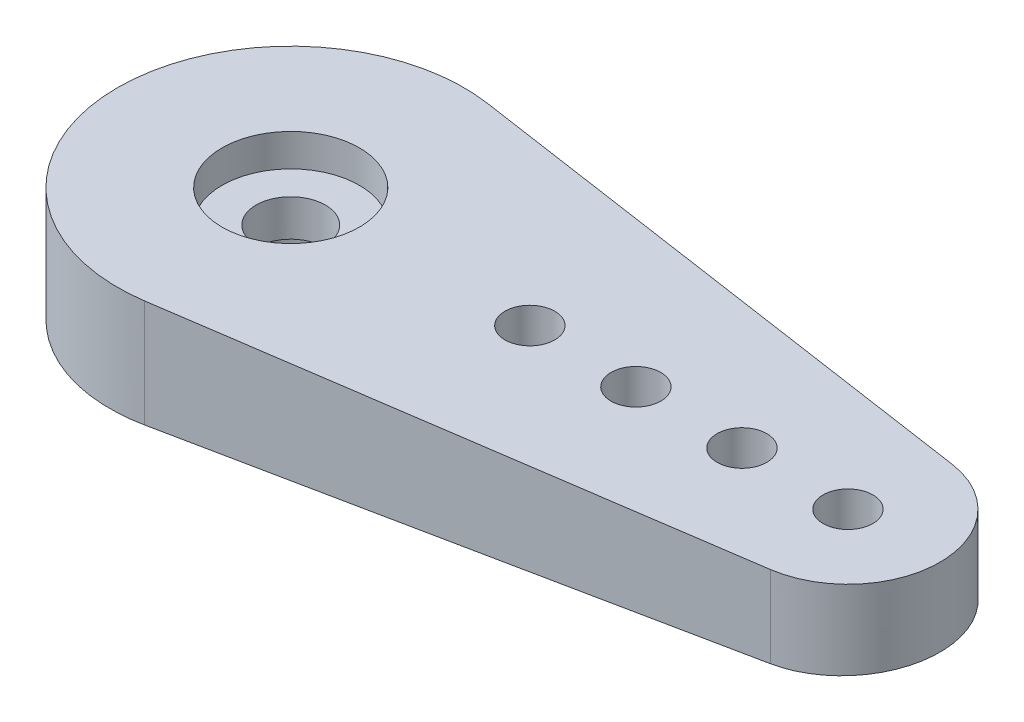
ISO-10303-21;
HEADER;
FILE_DESCRIPTION(('STEP AP214'),'2;1');
FILE_NAME('part.step','',(''),(''),'','','');
FILE_SCHEMA(('AUTOMOTIVE_DESIGN { 1 0 10303 214 1 1 1 1 }'));
ENDSEC;
DATA;
#1=APPLICATION_CONTEXT('core data for automotive mechanical design processes');
#2=APPLICATION_PROTOCOL_DEFINITION('international standard','automotive_design',2000,#1);
#3=PRODUCT_CONTEXT('',#1,'mechanical');
#4=PRODUCT('Part','Part','',(#3));
#5=PRODUCT_RELATED_PRODUCT_CATEGORY('part','',(#4));
#6=PRODUCT_DEFINITION_FORMATION('','',#4);
#7=PRODUCT_DEFINITION_CONTEXT('part definition',#1,'design');
#8=PRODUCT_DEFINITION('design','',#6,#7);
#9=PRODUCT_DEFINITION_SHAPE('','',#8);
#10=(LENGTH_UNIT() NAMED_UNIT(*) SI_UNIT(.MILLI.,.METRE.));
#11=(NAMED_UNIT(*) PLANE_ANGLE_UNIT() SI_UNIT($,.RADIAN.));
#12=(NAMED_UNIT(*) SI_UNIT($,.STERADIAN.) SOLID_ANGLE_UNIT());
#13=UNCERTAINTY_MEASURE_WITH_UNIT(LENGTH_MEASURE(1.E-05),#10,'distance_accuracy_value','');
#14=(GEOMETRIC_REPRESENTATION_CONTEXT(3) GLOBAL_UNCERTAINTY_ASSIGNED_CONTEXT((#13)) GLOBAL_UNIT_ASSIGNED_CONTEXT((#10,
#11,#12)) REPRESENTATION_CONTEXT('',''));
#15=CARTESIAN_POINT('',(0.,0.,0.));
#16=DIRECTION('',(0.,0.,1.));
#17=DIRECTION('',(1.,0.,0.));
#18=AXIS2_PLACEMENT_3D('',#15,#16,#17);
#19=CARTESIAN_POINT('',(0.,0.,0.));
#20=DIRECTION('',(0.,1.,0.));
#21=DIRECTION('',(0.,0.,1.));
#22=AXIS2_PLACEMENT_3D('',#19,#20,#21);
#23=PLANE('',#22);
#24=CARTESIAN_POINT('',(15.95,0.,0.));
#25=DIRECTION('',(0.,1.,0.));
#26=DIRECTION('',(0.,0.,1.));
#27=AXIS2_PLACEMENT_3D('',#24,#25,#26);
#28=CIRCLE('',#27,1.15);
#29=CARTESIAN_POINT('',(15.95,0.,1.15));
#30=VERTEX_POINT('',#29);
#31=EDGE_CURVE('E243',#30,#30,#28,.T.);
#32=ORIENTED_EDGE('',*,*,#31,.T.);
#33=EDGE_LOOP('',(#32));
#34=FACE_BOUND('',#33,.T.);
#35=CARTESIAN_POINT('',(25.75,0.,0.));
#36=DIRECTION('',(0.,1.,0.));
#37=DIRECTION('',(0.,0.,1.));
#38=AXIS2_PLACEMENT_3D('',#35,#36,#37);
#39=CIRCLE('',#38,1.15);
#40=CARTESIAN_POINT('',(25.75,0.,1.15));
#41=VERTEX_POINT('',#40);
#42=EDGE_CURVE('E231',#41,#41,#39,.T.);
#43=ORIENTED_EDGE('',*,*,#42,.T.);
#44=EDGE_LOOP('',(#43));
#45=FACE_BOUND('',#44,.T.);
#46=CARTESIAN_POINT('',(20.85,0.,0.));
#47=DIRECTION('',(0.,1.,0.));
#48=DIRECTION('',(0.,0.,1.));
#49=AXIS2_PLACEMENT_3D('',#46,#47,#48);
#50=CIRCLE('',#49,1.15);
#51=CARTESIAN_POINT('',(20.85,0.,1.15));
#52=VERTEX_POINT('',#51);
#53=EDGE_CURVE('E237',#52,#52,#50,.T.);
#54=ORIENTED_EDGE('',*,*,#53,.T.);
#55=EDGE_LOOP('',(#54));
#56=FACE_BOUND('',#55,.T.);
#57=CARTESIAN_POINT('',(11.05,0.,0.));
#58=DIRECTION('',(0.,1.,0.));
#59=DIRECTION('',(0.,0.,1.));
#60=AXIS2_PLACEMENT_3D('',#57,#58,#59);
#61=CIRCLE('',#60,1.15);
#62=CARTESIAN_POINT('',(11.05,0.,1.15000000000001));
#63=VERTEX_POINT('',#62);
#64=EDGE_CURVE('E208',#63,#63,#61,.T.);
#65=ORIENTED_EDGE('',*,*,#64,.T.);
#66=EDGE_LOOP('',(#65));
#67=FACE_BOUND('',#66,.T.);
#68=DIRECTION('',(0.,0.,1.));
#69=VECTOR('',#68,1.);
#70=CARTESIAN_POINT('',(0.6,0.,-5.3665631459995));
#71=LINE('',#70,#69);
#72=CARTESIAN_POINT('',(0.6,0.,-6.67308024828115));
#73=VERTEX_POINT('',#72);
#74=CARTESIAN_POINT('',(0.6,0.,-5.3665631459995));
#75=VERTEX_POINT('',#74);
#76=EDGE_CURVE('E193',#73,#75,#71,.T.);
#77=ORIENTED_EDGE('',*,*,#76,.F.);
#78=CARTESIAN_POINT('',(0.,0.,0.));
#79=DIRECTION('',(0.,-1.,0.));
#80=DIRECTION('',(0.,0.,-1.));
#81=AXIS2_PLACEMENT_3D('',#78,#79,#80);
#82=CIRCLE('',#81,6.7);
#83=CARTESIAN_POINT('',(0.975728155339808,0.,-6.6285710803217));
#84=VERTEX_POINT('',#83);
#85=EDGE_CURVE('E274',#73,#84,#82,.T.);
#86=ORIENTED_EDGE('',*,*,#85,.T.);
#87=DIRECTION('',(0.989338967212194,0.,0.145631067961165));
#88=VECTOR('',#87,1.);
#89=CARTESIAN_POINT('',(0.975728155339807,0.,-6.6285710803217));
#90=LINE('',#89,#88);
#91=CARTESIAN_POINT('',(26.1796116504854,0.,-2.91854995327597));
#92=VERTEX_POINT('',#91);
#93=EDGE_CURVE('E267',#84,#92,#90,.T.);
#94=ORIENTED_EDGE('',*,*,#93,.T.);
#95=CARTESIAN_POINT('',(25.75,0.,0.));
#96=DIRECTION('',(0.,-1.,0.));
#97=DIRECTION('',(0.,0.,-1.));
#98=AXIS2_PLACEMENT_3D('',#95,#96,#97);
#99=CIRCLE('',#98,2.95);
#100=CARTESIAN_POINT('',(26.1796116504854,0.,2.91854995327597));
#101=VERTEX_POINT('',#100);
#102=EDGE_CURVE('E278',#92,#101,#99,.T.);
#103=ORIENTED_EDGE('',*,*,#102,.T.);
#104=DIRECTION('',(-0.989338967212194,0.,0.145631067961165));
#105=VECTOR('',#104,1.);
#106=CARTESIAN_POINT('',(26.1796116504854,0.,2.91854995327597));
#107=LINE('',#106,#105);
#108=CARTESIAN_POINT('',(0.97572815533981,0.,6.6285710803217));
#109=VERTEX_POINT('',#108);
#110=EDGE_CURVE('E275',#101,#109,#107,.T.);
#111=ORIENTED_EDGE('',*,*,#110,.T.);
#112=CARTESIAN_POINT('',(0.6,0.,6.67308024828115));
#113=VERTEX_POINT('',#112);
#114=EDGE_CURVE('E270',#109,#113,#82,.T.);
#115=ORIENTED_EDGE('',*,*,#114,.T.);
#116=DIRECTION('',(0.,0.,1.));
#117=VECTOR('',#116,1.);
#118=CARTESIAN_POINT('',(0.6,0.,5.3665631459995));
#119=LINE('',#118,#117);
#120=CARTESIAN_POINT('',(0.6,0.,5.3665631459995));
#121=VERTEX_POINT('',#120);
#122=EDGE_CURVE('E327',#121,#113,#119,.T.);
#123=ORIENTED_EDGE('',*,*,#122,.F.);
#124=CARTESIAN_POINT('',(0.,0.,0.));
#125=DIRECTION('',(0.,1.,0.));
#126=DIRECTION('',(0.,0.,1.));
#127=AXIS2_PLACEMENT_3D('',#124,#125,#126);
#128=CIRCLE('',#127,5.4);
#129=EDGE_CURVE('E47',#75,#121,#128,.F.);
#130=ORIENTED_EDGE('',*,*,#129,.F.);
#131=EDGE_LOOP('',(#77,#86,#94,#103,#111,#115,#123,#130));
#132=FACE_BOUND('',#131,.T.);
#133=ADVANCED_FACE('F37',(#34,#45,#56,#67,#132),#23,.F.);
#134=DIRECTION('',(0.,0.,-1.));
#135=VECTOR('',#134,1.);
#136=CARTESIAN_POINT('',(-0.6,0.,-5.3665631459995));
#137=LINE('',#136,#135);
#138=CARTESIAN_POINT('',(-0.6,0.,-5.3665631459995));
#139=VERTEX_POINT('',#138);
#140=CARTESIAN_POINT('',(-0.599999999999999,0.,-6.67308024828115));
#141=VERTEX_POINT('',#140);
#142=EDGE_CURVE('E179',#139,#141,#137,.T.);
#143=ORIENTED_EDGE('',*,*,#142,.F.);
#144=CARTESIAN_POINT('',(-5.3665631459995,0.,-0.6));
#145=VERTEX_POINT('',#144);
#146=EDGE_CURVE('E46',#145,#139,#128,.F.);
#147=ORIENTED_EDGE('',*,*,#146,.F.);
#148=DIRECTION('',(1.,0.,0.));
#149=VECTOR('',#148,1.);
#150=CARTESIAN_POINT('',(-6.67308024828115,0.,-0.6));
#151=LINE('',#150,#149);
#152=CARTESIAN_POINT('',(-6.67308024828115,0.,-0.600000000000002));
#153=VERTEX_POINT('',#152);
#154=EDGE_CURVE('E344',#153,#145,#151,.T.);
#155=ORIENTED_EDGE('',*,*,#154,.F.);
#156=EDGE_CURVE('E192',#153,#141,#82,.T.);
#157=ORIENTED_EDGE('',*,*,#156,.T.);
#158=EDGE_LOOP('',(#143,#147,#155,#157));
#159=FACE_BOUND('',#158,.T.);
#160=ADVANCED_FACE('F189',(#159),#23,.F.);
#161=CARTESIAN_POINT('',(0.,-4.,0.));
#162=DIRECTION('',(0.,1.,0.));
#163=DIRECTION('',(0.,0.,1.));
#164=AXIS2_PLACEMENT_3D('',#161,#162,#163);
#165=CYLINDRICAL_SURFACE('',#164,6.7);
#166=ORIENTED_EDGE('',*,*,#85,.F.);
#167=DIRECTION('',(0.,1.,0.));
#168=VECTOR('',#167,1.);
#169=CARTESIAN_POINT('',(0.6,-3.60173884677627,-6.67308024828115));
#170=LINE('',#169,#168);
#171=CARTESIAN_POINT('',(0.6,-1.49263157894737,-6.67308024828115));
#172=VERTEX_POINT('',#171);
#173=EDGE_CURVE('E353',#172,#73,#170,.T.);
#174=ORIENTED_EDGE('',*,*,#173,.F.);
#175=CARTESIAN_POINT('',(0.,-1.52105263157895,0.));
#176=DIRECTION('',(-0.0473153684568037,0.998880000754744,0.));
#177=DIRECTION('',(0.998880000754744,0.0473153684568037,0.));
#178=AXIS2_PLACEMENT_3D('',#175,#176,#177);
#179=ELLIPSE('',#178,6.70751240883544,6.7);
#180=CARTESIAN_POINT('',(0.975728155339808,-1.47483392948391,-6.6285710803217));
#181=VERTEX_POINT('',#180);
#182=EDGE_CURVE('E295',#181,#172,#179,.T.);
#183=ORIENTED_EDGE('',*,*,#182,.F.);
#184=DIRECTION('',(0.,1.,0.));
#185=VECTOR('',#184,1.);
#186=CARTESIAN_POINT('',(0.975728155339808,-4.,-6.6285710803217));
#187=LINE('',#186,#185);
#188=EDGE_CURVE('E262',#181,#84,#187,.T.);
#189=ORIENTED_EDGE('',*,*,#188,.T.);
#190=EDGE_LOOP('',(#166,#174,#183,#189));
#191=FACE_BOUND('',#190,.T.);
#192=ADVANCED_FACE('F374',(#191),#165,.F.);
#193=CARTESIAN_POINT('',(-0.6,-1.54947368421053,-6.67308024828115));
#194=VERTEX_POINT('',#193);
#195=CARTESIAN_POINT('',(-6.67308024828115,-1.83714590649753,-0.600000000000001));
#196=VERTEX_POINT('',#195);
#197=EDGE_CURVE('E298',#194,#196,#179,.T.);
#198=ORIENTED_EDGE('',*,*,#197,.F.);
#199=DIRECTION('',(0.,1.,0.));
#200=VECTOR('',#199,1.);
#201=CARTESIAN_POINT('',(-0.599999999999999,-3.60173884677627,-6.67308024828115));
#202=LINE('',#201,#200);
#203=EDGE_CURVE('E54',#194,#141,#202,.T.);
#204=ORIENTED_EDGE('',*,*,#203,.T.);
#205=ORIENTED_EDGE('',*,*,#156,.F.);
#206=DIRECTION('',(0.,1.,0.));
#207=VECTOR('',#206,1.);
#208=CARTESIAN_POINT('',(-6.67308024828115,-3.60173884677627,-0.600000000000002));
#209=LINE('',#208,#207);
#210=EDGE_CURVE('E341',#196,#153,#209,.T.);
#211=ORIENTED_EDGE('',*,*,#210,.F.);
#212=EDGE_LOOP('',(#198,#204,#205,#211));
#213=FACE_BOUND('',#212,.T.);
#214=ADVANCED_FACE('F436',(#213),#165,.F.);
#215=CARTESIAN_POINT('',(0.,-25.7735064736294,0.));
#216=DIRECTION('',(0.,1.,0.));
#217=DIRECTION('',(0.,0.,1.));
#218=AXIS2_PLACEMENT_3D('',#215,#216,#217);
#219=CYLINDRICAL_SURFACE('',#218,5.4);
#220=CARTESIAN_POINT('',(0.,-3.5,0.));
#221=DIRECTION('',(0.,1.,0.));
#222=DIRECTION('',(0.,0.,1.));
#223=AXIS2_PLACEMENT_3D('',#220,#221,#222);
#224=CIRCLE('',#223,5.4);
#225=CARTESIAN_POINT('',(0.,-3.5,5.4));
#226=VERTEX_POINT('',#225);
#227=EDGE_CURVE('E300',#226,#226,#224,.T.);
#228=ORIENTED_EDGE('',*,*,#227,.T.);
#229=EDGE_LOOP('',(#228));
#230=FACE_BOUND('',#229,.T.);
#231=DIRECTION('',(0.,1.,0.));
#232=VECTOR('',#231,1.);
#233=CARTESIAN_POINT('',(0.6,-3.60173884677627,-5.3665631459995));
#234=LINE('',#233,#232);
#235=CARTESIAN_POINT('',(0.6,-1.49263157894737,-5.3665631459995));
#236=VERTEX_POINT('',#235);
#237=EDGE_CURVE('E355',#236,#75,#234,.T.);
#238=ORIENTED_EDGE('',*,*,#237,.T.);
#239=ORIENTED_EDGE('',*,*,#129,.T.);
#240=DIRECTION('',(0.,1.,0.));
#241=VECTOR('',#240,1.);
#242=CARTESIAN_POINT('',(0.6,-3.60173884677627,5.3665631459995));
#243=LINE('',#242,#241);
#244=CARTESIAN_POINT('',(0.6,-1.49263157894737,5.3665631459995));
#245=VERTEX_POINT('',#244);
#246=EDGE_CURVE('E314',#245,#121,#243,.T.);
#247=ORIENTED_EDGE('',*,*,#246,.F.);
#248=CARTESIAN_POINT('',(0.,-1.52105263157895,0.));
#249=DIRECTION('',(-0.0473153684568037,0.998880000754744,0.));
#250=DIRECTION('',(0.998880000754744,0.0473153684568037,0.));
#251=AXIS2_PLACEMENT_3D('',#248,#249,#250);
#252=ELLIPSE('',#251,5.40605477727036,5.4);
#253=CARTESIAN_POINT('',(-0.6,-1.54947368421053,5.3665631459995));
#254=VERTEX_POINT('',#253);
#255=EDGE_CURVE('E307',#245,#254,#252,.F.);
#256=ORIENTED_EDGE('',*,*,#255,.T.);
#257=DIRECTION('',(0.,1.,0.));
#258=VECTOR('',#257,1.);
#259=CARTESIAN_POINT('',(-0.6,-3.60173884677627,5.3665631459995));
#260=LINE('',#259,#258);
#261=CARTESIAN_POINT('',(-0.6,0.,5.3665631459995));
#262=VERTEX_POINT('',#261);
#263=EDGE_CURVE('E322',#254,#262,#260,.T.);
#264=ORIENTED_EDGE('',*,*,#263,.T.);
#265=CARTESIAN_POINT('',(-5.3665631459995,0.,0.6));
#266=VERTEX_POINT('',#265);
#267=EDGE_CURVE('E12',#262,#266,#128,.F.);
#268=ORIENTED_EDGE('',*,*,#267,.T.);
#269=DIRECTION('',(0.,1.,0.));
#270=VECTOR('',#269,1.);
#271=CARTESIAN_POINT('',(-5.3665631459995,-3.60173884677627,0.6));
#272=LINE('',#271,#270);
#273=CARTESIAN_POINT('',(-5.3665631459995,-1.77525825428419,0.6));
#274=VERTEX_POINT('',#273);
#275=EDGE_CURVE('E338',#274,#266,#272,.T.);
#276=ORIENTED_EDGE('',*,*,#275,.F.);
#277=CARTESIAN_POINT('',(0.,-1.52105263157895,0.));
#278=DIRECTION('',(-0.0473153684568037,0.998880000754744,0.));
#279=DIRECTION('',(0.998880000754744,0.0473153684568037,0.));
#280=AXIS2_PLACEMENT_3D('',#277,#278,#279);
#281=ELLIPSE('',#280,5.40605477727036,5.4);
#282=CARTESIAN_POINT('',(-5.3665631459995,-1.77525825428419,-0.6));
#283=VERTEX_POINT('',#282);
#284=EDGE_CURVE('E330',#274,#283,#281,.F.);
#285=ORIENTED_EDGE('',*,*,#284,.T.);
#286=DIRECTION('',(0.,1.,0.));
#287=VECTOR('',#286,1.);
#288=CARTESIAN_POINT('',(-5.3665631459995,-3.60173884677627,-0.6));
#289=LINE('',#288,#287);
#290=EDGE_CURVE('E200',#283,#145,#289,.T.);
#291=ORIENTED_EDGE('',*,*,#290,.T.);
#292=ORIENTED_EDGE('',*,*,#146,.T.);
#293=DIRECTION('',(0.,1.,0.));
#294=VECTOR('',#293,1.);
#295=CARTESIAN_POINT('',(-0.6,-3.60173884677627,-5.3665631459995));
#296=LINE('',#295,#294);
#297=CARTESIAN_POINT('',(-0.6,-1.54947368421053,-5.3665631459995));
#298=VERTEX_POINT('',#297);
#299=EDGE_CURVE('E176',#298,#139,#296,.T.);
#300=ORIENTED_EDGE('',*,*,#299,.F.);
#301=CARTESIAN_POINT('',(0.,-1.52105263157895,0.));
#302=DIRECTION('',(-0.0473153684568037,0.998880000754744,0.));
#303=DIRECTION('',(0.998880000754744,0.0473153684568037,0.));
#304=AXIS2_PLACEMENT_3D('',#301,#302,#303);
#305=ELLIPSE('',#304,5.40605477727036,5.4);
#306=EDGE_CURVE('E348',#298,#236,#305,.F.);
#307=ORIENTED_EDGE('',*,*,#306,.T.);
#308=EDGE_LOOP('',(#238,#239,#247,#256,#264,#268,#276,#285,#291,#292,#300,#307));
#309=FACE_BOUND('',#308,.T.);
#310=ADVANCED_FACE('F197',(#230,#309),#219,.T.);
#311=DIRECTION('',(-1.,0.,0.));
#312=VECTOR('',#311,1.);
#313=CARTESIAN_POINT('',(-5.3665631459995,0.,0.6));
#314=LINE('',#313,#312);
#315=CARTESIAN_POINT('',(-6.67308024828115,0.,0.6));
#316=VERTEX_POINT('',#315);
#317=EDGE_CURVE('E346',#266,#316,#314,.T.);
#318=ORIENTED_EDGE('',*,*,#317,.F.);
#319=ORIENTED_EDGE('',*,*,#267,.F.);
#320=DIRECTION('',(0.,0.,-1.));
#321=VECTOR('',#320,1.);
#322=CARTESIAN_POINT('',(-0.6,0.,6.67308024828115));
#323=LINE('',#322,#321);
#324=CARTESIAN_POINT('',(-0.6,0.,6.67308024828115));
#325=VERTEX_POINT('',#324);
#326=EDGE_CURVE('E324',#325,#262,#323,.T.);
#327=ORIENTED_EDGE('',*,*,#326,.F.);
#328=EDGE_CURVE('E273',#325,#316,#82,.T.);
#329=ORIENTED_EDGE('',*,*,#328,.T.);
#330=EDGE_LOOP('',(#318,#319,#327,#329));
#331=FACE_BOUND('',#330,.T.);
#332=ADVANCED_FACE('F381',(#331),#23,.F.);
#333=CARTESIAN_POINT('',(-6.67308024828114,-1.83714590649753,0.6));
#334=VERTEX_POINT('',#333);
#335=CARTESIAN_POINT('',(-0.600000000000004,-1.54947368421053,6.67308024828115));
#336=VERTEX_POINT('',#335);
#337=EDGE_CURVE('E393',#334,#336,#179,.T.);
#338=ORIENTED_EDGE('',*,*,#337,.F.);
#339=DIRECTION('',(0.,1.,0.));
#340=VECTOR('',#339,1.);
#341=CARTESIAN_POINT('',(-6.67308024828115,-3.60173884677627,0.6));
#342=LINE('',#341,#340);
#343=EDGE_CURVE('E62',#334,#316,#342,.T.);
#344=ORIENTED_EDGE('',*,*,#343,.T.);
#345=ORIENTED_EDGE('',*,*,#328,.F.);
#346=DIRECTION('',(0.,1.,0.));
#347=VECTOR('',#346,1.);
#348=CARTESIAN_POINT('',(-0.6,-3.60173884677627,6.67308024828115));
#349=LINE('',#348,#347);
#350=EDGE_CURVE('E319',#336,#325,#349,.T.);
#351=ORIENTED_EDGE('',*,*,#350,.F.);
#352=EDGE_LOOP('',(#338,#344,#345,#351));
#353=FACE_BOUND('',#352,.T.);
#354=ADVANCED_FACE('F386',(#353),#165,.F.);
#355=CARTESIAN_POINT('',(0.6,-1.49263157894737,6.67308024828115));
#356=VERTEX_POINT('',#355);
#357=CARTESIAN_POINT('',(0.97572815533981,-1.4748339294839,6.6285710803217));
#358=VERTEX_POINT('',#357);
#359=EDGE_CURVE('E299',#356,#358,#179,.T.);
#360=ORIENTED_EDGE('',*,*,#359,.F.);
#361=DIRECTION('',(0.,1.,0.));
#362=VECTOR('',#361,1.);
#363=CARTESIAN_POINT('',(0.600000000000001,-3.60173884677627,6.67308024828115));
#364=LINE('',#363,#362);
#365=EDGE_CURVE('E317',#356,#113,#364,.T.);
#366=ORIENTED_EDGE('',*,*,#365,.T.);
#367=ORIENTED_EDGE('',*,*,#114,.F.);
#368=DIRECTION('',(0.,1.,0.));
#369=VECTOR('',#368,1.);
#370=CARTESIAN_POINT('',(0.97572815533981,-4.,6.6285710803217));
#371=LINE('',#370,#369);
#372=EDGE_CURVE('E260',#358,#109,#371,.T.);
#373=ORIENTED_EDGE('',*,*,#372,.F.);
#374=EDGE_LOOP('',(#360,#366,#367,#373));
#375=FACE_BOUND('',#374,.T.);
#376=ADVANCED_FACE('F404',(#375),#165,.F.);
#377=CARTESIAN_POINT('',(0.,3.5,0.));
#378=DIRECTION('',(0.,-1.,0.));
#379=DIRECTION('',(0.,0.,-1.));
#380=AXIS2_PLACEMENT_3D('',#377,#378,#379);
#381=CYLINDRICAL_SURFACE('',#380,1.6);
#382=CARTESIAN_POINT('',(0.,2.,0.));
#383=DIRECTION('',(0.,1.,0.));
#384=DIRECTION('',(0.,0.,1.));
#385=AXIS2_PLACEMENT_3D('',#382,#383,#384);
#386=CIRCLE('',#385,1.6);
#387=CARTESIAN_POINT('',(0.,2.,1.6));
#388=VERTEX_POINT('',#387);
#389=EDGE_CURVE('E205',#388,#388,#386,.T.);
#390=ORIENTED_EDGE('',*,*,#389,.T.);
#391=EDGE_LOOP('',(#390));
#392=FACE_BOUND('',#391,.T.);
#393=CARTESIAN_POINT('',(0.,0.3,0.));
#394=DIRECTION('',(0.,-1.,0.));
#395=DIRECTION('',(0.,0.,-1.));
#396=AXIS2_PLACEMENT_3D('',#393,#394,#395);
#397=CIRCLE('',#396,1.6);
#398=CARTESIAN_POINT('',(0.,0.3,-1.6));
#399=VERTEX_POINT('',#398);
#400=EDGE_CURVE('E41',#399,#399,#397,.T.);
#401=ORIENTED_EDGE('',*,*,#400,.T.);
#402=EDGE_LOOP('',(#401));
#403=FACE_BOUND('',#402,.T.);
#404=ADVANCED_FACE('F519',(#392,#403),#381,.F.);
#405=CARTESIAN_POINT('',(0.,3.5,0.));
#406=DIRECTION('',(0.,1.,0.));
#407=DIRECTION('',(0.,0.,1.));
#408=AXIS2_PLACEMENT_3D('',#405,#406,#407);
#409=PLANE('',#408);
#410=CARTESIAN_POINT('',(0.,3.5,0.));
#411=DIRECTION('',(0.,1.,0.));
#412=DIRECTION('',(0.,0.,1.));
#413=AXIS2_PLACEMENT_3D('',#410,#411,#412);
#414=CIRCLE('',#413,3.175);
#415=CARTESIAN_POINT('',(0.,3.5,3.175));
#416=VERTEX_POINT('',#415);
#417=EDGE_CURVE('E253',#416,#416,#414,.T.);
#418=ORIENTED_EDGE('',*,*,#417,.F.);
#419=EDGE_LOOP('',(#418));
#420=FACE_BOUND('',#419,.T.);
#421=CARTESIAN_POINT('',(15.95,3.5,0.));
#422=DIRECTION('',(0.,1.,0.));
#423=DIRECTION('',(0.,0.,1.));
#424=AXIS2_PLACEMENT_3D('',#421,#422,#423);
#425=CIRCLE('',#424,1.15);
#426=CARTESIAN_POINT('',(15.95,3.5,1.15));
#427=VERTEX_POINT('',#426);
#428=EDGE_CURVE('E240',#427,#427,#425,.T.);
#429=ORIENTED_EDGE('',*,*,#428,.F.);
#430=EDGE_LOOP('',(#429));
#431=FACE_BOUND('',#430,.T.);
#432=CARTESIAN_POINT('',(25.75,3.5,0.));
#433=DIRECTION('',(0.,1.,0.));
#434=DIRECTION('',(0.,0.,1.));
#435=AXIS2_PLACEMENT_3D('',#432,#433,#434);
#436=CIRCLE('',#435,1.15);
#437=CARTESIAN_POINT('',(25.75,3.5,1.15));
#438=VERTEX_POINT('',#437);
#439=EDGE_CURVE('E230',#438,#438,#436,.T.);
#440=ORIENTED_EDGE('',*,*,#439,.F.);
#441=EDGE_LOOP('',(#440));
#442=FACE_BOUND('',#441,.T.);
#443=CARTESIAN_POINT('',(0.,3.5,0.));
#444=DIRECTION('',(0.,1.,0.));
#445=DIRECTION('',(0.,0.,1.));
#446=AXIS2_PLACEMENT_3D('',#443,#444,#445);
#447=CIRCLE('',#446,8.);
#448=CARTESIAN_POINT('',(1.16504854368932,3.5,-7.91471173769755));
#449=VERTEX_POINT('',#448);
#450=CARTESIAN_POINT('',(1.16504854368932,3.5,7.91471173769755));
#451=VERTEX_POINT('',#450);
#452=EDGE_CURVE('E227',#449,#451,#447,.T.);
#453=ORIENTED_EDGE('',*,*,#452,.T.);
#454=DIRECTION('',(0.989338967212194,0.,-0.145631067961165));
#455=VECTOR('',#454,1.);
#456=CARTESIAN_POINT('',(1.16504854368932,3.5,7.91471173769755));
#457=LINE('',#456,#455);
#458=CARTESIAN_POINT('',(26.368932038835,3.5,4.20469061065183));
#459=VERTEX_POINT('',#458);
#460=EDGE_CURVE('E225',#451,#459,#457,.T.);
#461=ORIENTED_EDGE('',*,*,#460,.T.);
#462=CARTESIAN_POINT('',(25.75,3.5,0.));
#463=DIRECTION('',(0.,1.,0.));
#464=DIRECTION('',(0.,0.,1.));
#465=AXIS2_PLACEMENT_3D('',#462,#463,#464);
#466=CIRCLE('',#465,4.25);
#467=CARTESIAN_POINT('',(26.368932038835,3.5,-4.20469061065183));
#468=VERTEX_POINT('',#467);
#469=EDGE_CURVE('E223',#459,#468,#466,.T.);
#470=ORIENTED_EDGE('',*,*,#469,.T.);
#471=DIRECTION('',(-0.989338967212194,0.,-0.145631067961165));
#472=VECTOR('',#471,1.);
#473=CARTESIAN_POINT('',(26.368932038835,3.5,-4.20469061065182));
#474=LINE('',#473,#472);
#475=EDGE_CURVE('E221',#468,#449,#474,.T.);
#476=ORIENTED_EDGE('',*,*,#475,.T.);
#477=EDGE_LOOP('',(#453,#461,#470,#476));
#478=FACE_BOUND('',#477,.T.);
#479=CARTESIAN_POINT('',(20.85,3.5,0.));
#480=DIRECTION('',(0.,1.,0.));
#481=DIRECTION('',(0.,0.,1.));
#482=AXIS2_PLACEMENT_3D('',#479,#480,#481);
#483=CIRCLE('',#482,1.15);
#484=CARTESIAN_POINT('',(20.85,3.5,1.15));
#485=VERTEX_POINT('',#484);
#486=EDGE_CURVE('E234',#485,#485,#483,.T.);
#487=ORIENTED_EDGE('',*,*,#486,.F.);
#488=EDGE_LOOP('',(#487));
#489=FACE_BOUND('',#488,.T.);
#490=CARTESIAN_POINT('',(11.05,3.5,0.));
#491=DIRECTION('',(0.,1.,0.));
#492=DIRECTION('',(0.,0.,1.));
#493=AXIS2_PLACEMENT_3D('',#490,#491,#492);
#494=CIRCLE('',#493,1.15);
#495=CARTESIAN_POINT('',(11.05,3.5,1.15000000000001));
#496=VERTEX_POINT('',#495);
#497=EDGE_CURVE('E246',#496,#496,#494,.T.);
#498=ORIENTED_EDGE('',*,*,#497,.F.);
#499=EDGE_LOOP('',(#498));
#500=FACE_BOUND('',#499,.T.);
#501=ADVANCED_FACE('F582',(#420,#431,#442,#478,#489,#500),#409,.T.);
#502=CARTESIAN_POINT('',(0.,3.5,0.));
#503=DIRECTION('',(0.,-1.,0.));
#504=DIRECTION('',(0.,0.,-1.));
#505=AXIS2_PLACEMENT_3D('',#502,#503,#504);
#506=CYLINDRICAL_SURFACE('',#505,8.);
#507=DIRECTION('',(0.,-1.,0.));
#508=VECTOR('',#507,1.);
#509=CARTESIAN_POINT('',(1.16504854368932,3.5,-7.91471173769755));
#510=LINE('',#509,#508);
#511=CARTESIAN_POINT('',(1.16504854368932,-1.46586612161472,-7.91471173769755));
#512=VERTEX_POINT('',#511);
#513=EDGE_CURVE('E218',#449,#512,#510,.T.);
#514=ORIENTED_EDGE('',*,*,#513,.T.);
#515=CARTESIAN_POINT('',(0.,-1.52105263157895,0.));
#516=DIRECTION('',(-0.0473153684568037,0.998880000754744,0.));
#517=DIRECTION('',(-0.998880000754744,-0.0473153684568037,0.));
#518=AXIS2_PLACEMENT_3D('',#515,#516,#517);
#519=ELLIPSE('',#518,8.00897004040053,8.);
#520=CARTESIAN_POINT('',(1.16504854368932,-1.46586612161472,7.91471173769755));
#521=VERTEX_POINT('',#520);
#522=EDGE_CURVE('E281',#512,#521,#519,.T.);
#523=ORIENTED_EDGE('',*,*,#522,.T.);
#524=DIRECTION('',(0.,-1.,0.));
#525=VECTOR('',#524,1.);
#526=CARTESIAN_POINT('',(1.16504854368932,3.5,7.91471173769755));
#527=LINE('',#526,#525);
#528=EDGE_CURVE('E204',#451,#521,#527,.T.);
#529=ORIENTED_EDGE('',*,*,#528,.F.);
#530=ORIENTED_EDGE('',*,*,#452,.F.);
#531=EDGE_LOOP('',(#514,#523,#529,#530));
#532=FACE_BOUND('',#531,.T.);
#533=ADVANCED_FACE('F39',(#532),#506,.T.);
#534=CARTESIAN_POINT('',(1.16504854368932,3.5,7.91471173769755));
#535=DIRECTION('',(-0.145631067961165,0.,-0.989338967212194));
#536=DIRECTION('',(-0.989338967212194,0.,0.145631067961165));
#537=AXIS2_PLACEMENT_3D('',#534,#535,#536);
#538=PLANE('',#537);
#539=ORIENTED_EDGE('',*,*,#528,.T.);
#540=DIRECTION('',(0.988254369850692,0.0468120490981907,-0.145471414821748));
#541=VECTOR('',#540,1.);
#542=CARTESIAN_POINT('',(1.39478049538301,-1.45498408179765,7.88089510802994));
#543=LINE('',#542,#541);
#544=CARTESIAN_POINT('',(26.368932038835,-0.271997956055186,4.20469061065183));
#545=VERTEX_POINT('',#544);
#546=EDGE_CURVE('E282',#521,#545,#543,.T.);
#547=ORIENTED_EDGE('',*,*,#546,.T.);
#548=DIRECTION('',(0.,-1.,0.));
#549=VECTOR('',#548,1.);
#550=CARTESIAN_POINT('',(26.368932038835,3.5,4.20469061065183));
#551=LINE('',#550,#549);
#552=EDGE_CURVE('E212',#459,#545,#551,.T.);
#553=ORIENTED_EDGE('',*,*,#552,.F.);
#554=ORIENTED_EDGE('',*,*,#460,.F.);
#555=EDGE_LOOP('',(#539,#547,#553,#554));
#556=FACE_BOUND('',#555,.T.);
#557=ADVANCED_FACE('F627',(#556),#538,.F.);
#558=CARTESIAN_POINT('',(25.75,3.5,0.));
#559=DIRECTION('',(0.,-1.,0.));
#560=DIRECTION('',(0.,0.,-1.));
#561=AXIS2_PLACEMENT_3D('',#558,#559,#560);
#562=CYLINDRICAL_SURFACE('',#561,4.25);
#563=CARTESIAN_POINT('',(25.75,-0.301315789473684,0.));
#564=DIRECTION('',(-0.0473153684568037,0.998880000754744,0.));
#565=DIRECTION('',(-0.998880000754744,-0.0473153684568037,0.));
#566=AXIS2_PLACEMENT_3D('',#563,#564,#565);
#567=ELLIPSE('',#566,4.25476533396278,4.25);
#568=CARTESIAN_POINT('',(26.368932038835,-0.271997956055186,-4.20469061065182));
#569=VERTEX_POINT('',#568);
#570=EDGE_CURVE('E285',#545,#569,#567,.T.);
#571=ORIENTED_EDGE('',*,*,#570,.T.);
#572=DIRECTION('',(0.,-1.,0.));
#573=VECTOR('',#572,1.);
#574=CARTESIAN_POINT('',(26.368932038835,3.5,-4.20469061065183));
#575=LINE('',#574,#573);
#576=EDGE_CURVE('E215',#468,#569,#575,.T.);
#577=ORIENTED_EDGE('',*,*,#576,.F.);
#578=ORIENTED_EDGE('',*,*,#469,.F.);
#579=ORIENTED_EDGE('',*,*,#552,.T.);
#580=EDGE_LOOP('',(#571,#577,#578,#579));
#581=FACE_BOUND('',#580,.T.);
#582=ADVANCED_FACE('F616',(#581),#562,.T.);
#583=CARTESIAN_POINT('',(26.368932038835,3.5,-4.20469061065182));
#584=DIRECTION('',(-0.145631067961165,0.,0.989338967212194));
#585=DIRECTION('',(0.989338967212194,0.,0.145631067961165));
#586=AXIS2_PLACEMENT_3D('',#583,#584,#585);
#587=PLANE('',#586);
#588=ORIENTED_EDGE('',*,*,#576,.T.);
#589=DIRECTION('',(-0.988254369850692,-0.0468120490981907,-0.145471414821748));
#590=VECTOR('',#589,1.);
#591=CARTESIAN_POINT('',(26.5434330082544,-0.263732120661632,-4.1790040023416));
#592=LINE('',#591,#590);
#593=EDGE_CURVE('E288',#569,#512,#592,.T.);
#594=ORIENTED_EDGE('',*,*,#593,.T.);
#595=ORIENTED_EDGE('',*,*,#513,.F.);
#596=ORIENTED_EDGE('',*,*,#475,.F.);
#597=EDGE_LOOP('',(#588,#594,#595,#596));
#598=FACE_BOUND('',#597,.T.);
#599=ADVANCED_FACE('F611',(#598),#587,.F.);
#600=CARTESIAN_POINT('',(25.75,3.5,0.));
#601=DIRECTION('',(0.,-1.,0.));
#602=DIRECTION('',(0.,0.,-1.));
#603=AXIS2_PLACEMENT_3D('',#600,#601,#602);
#604=CYLINDRICAL_SURFACE('',#603,1.15);
#605=ORIENTED_EDGE('',*,*,#439,.T.);
#606=EDGE_LOOP('',(#605));
#607=FACE_BOUND('',#606,.T.);
#608=ORIENTED_EDGE('',*,*,#42,.F.);
#609=EDGE_LOOP('',(#608));
#610=FACE_BOUND('',#609,.T.);
#611=ADVANCED_FACE('F615',(#607,#610),#604,.F.);
#612=CARTESIAN_POINT('',(20.85,3.5,0.));
#613=DIRECTION('',(0.,-1.,0.));
#614=DIRECTION('',(0.,0.,-1.));
#615=AXIS2_PLACEMENT_3D('',#612,#613,#614);
#616=CYLINDRICAL_SURFACE('',#615,1.15);
#617=ORIENTED_EDGE('',*,*,#486,.T.);
#618=EDGE_LOOP('',(#617));
#619=FACE_BOUND('',#618,.T.);
#620=ORIENTED_EDGE('',*,*,#53,.F.);
#621=EDGE_LOOP('',(#620));
#622=FACE_BOUND('',#621,.T.);
#623=ADVANCED_FACE('F692',(#619,#622),#616,.F.);
#624=CARTESIAN_POINT('',(15.95,3.5,0.));
#625=DIRECTION('',(0.,-1.,0.));
#626=DIRECTION('',(0.,0.,-1.));
#627=AXIS2_PLACEMENT_3D('',#624,#625,#626);
#628=CYLINDRICAL_SURFACE('',#627,1.15);
#629=ORIENTED_EDGE('',*,*,#428,.T.);
#630=EDGE_LOOP('',(#629));
#631=FACE_BOUND('',#630,.T.);
#632=ORIENTED_EDGE('',*,*,#31,.F.);
#633=EDGE_LOOP('',(#632));
#634=FACE_BOUND('',#633,.T.);
#635=ADVANCED_FACE('F682',(#631,#634),#628,.F.);
#636=CARTESIAN_POINT('',(11.05,3.5,0.));
#637=DIRECTION('',(0.,-1.,0.));
#638=DIRECTION('',(0.,0.,-1.));
#639=AXIS2_PLACEMENT_3D('',#636,#637,#638);
#640=CYLINDRICAL_SURFACE('',#639,1.15);
#641=ORIENTED_EDGE('',*,*,#497,.T.);
#642=EDGE_LOOP('',(#641));
#643=FACE_BOUND('',#642,.T.);
#644=ORIENTED_EDGE('',*,*,#64,.F.);
#645=EDGE_LOOP('',(#644));
#646=FACE_BOUND('',#645,.T.);
#647=ADVANCED_FACE('F665',(#643,#646),#640,.F.);
#648=CARTESIAN_POINT('',(0.,2.,0.));
#649=DIRECTION('',(0.,1.,0.));
#650=DIRECTION('',(0.,0.,1.));
#651=AXIS2_PLACEMENT_3D('',#648,#649,#650);
#652=CYLINDRICAL_SURFACE('',#651,3.175);
#653=CARTESIAN_POINT('',(0.,2.,0.));
#654=DIRECTION('',(0.,1.,0.));
#655=DIRECTION('',(0.,0.,1.));
#656=AXIS2_PLACEMENT_3D('',#653,#654,#655);
#657=CIRCLE('',#656,3.175);
#658=CARTESIAN_POINT('',(0.,2.,3.175));
#659=VERTEX_POINT('',#658);
#660=EDGE_CURVE('E209',#659,#659,#657,.T.);
#661=ORIENTED_EDGE('',*,*,#660,.F.);
#662=EDGE_LOOP('',(#661));
#663=FACE_BOUND('',#662,.T.);
#664=ORIENTED_EDGE('',*,*,#417,.T.);
#665=EDGE_LOOP('',(#664));
#666=FACE_BOUND('',#665,.T.);
#667=ADVANCED_FACE('F655',(#663,#666),#652,.F.);
#668=CARTESIAN_POINT('',(0.,2.,0.));
#669=DIRECTION('',(0.,1.,0.));
#670=DIRECTION('',(0.,0.,1.));
#671=AXIS2_PLACEMENT_3D('',#668,#669,#670);
#672=PLANE('',#671);
#673=ORIENTED_EDGE('',*,*,#389,.F.);
#674=EDGE_LOOP('',(#673));
#675=FACE_BOUND('',#674,.T.);
#676=ORIENTED_EDGE('',*,*,#660,.T.);
#677=EDGE_LOOP('',(#676));
#678=FACE_BOUND('',#677,.T.);
#679=ADVANCED_FACE('F604',(#675,#678),#672,.T.);
#680=CARTESIAN_POINT('',(25.75,-4.,0.));
#681=DIRECTION('',(0.,1.,0.));
#682=DIRECTION('',(0.,0.,1.));
#683=AXIS2_PLACEMENT_3D('',#680,#681,#682);
#684=CYLINDRICAL_SURFACE('',#683,2.95);
#685=CARTESIAN_POINT('',(25.75,-0.301315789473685,0.));
#686=DIRECTION('',(-0.0473153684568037,0.998880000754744,0.));
#687=DIRECTION('',(0.998880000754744,0.0473153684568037,0.));
#688=AXIS2_PLACEMENT_3D('',#685,#686,#687);
#689=ELLIPSE('',#688,2.9533077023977,2.95);
#690=CARTESIAN_POINT('',(26.1796116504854,-0.280965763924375,2.91854995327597));
#691=VERTEX_POINT('',#690);
#692=CARTESIAN_POINT('',(26.1796116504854,-0.280965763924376,-2.91854995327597));
#693=VERTEX_POINT('',#692);
#694=EDGE_CURVE('E291',#691,#693,#689,.T.);
#695=ORIENTED_EDGE('',*,*,#694,.F.);
#696=DIRECTION('',(0.,1.,0.));
#697=VECTOR('',#696,1.);
#698=CARTESIAN_POINT('',(26.1796116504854,-4.,2.91854995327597));
#699=LINE('',#698,#697);
#700=EDGE_CURVE('E256',#691,#101,#699,.T.);
#701=ORIENTED_EDGE('',*,*,#700,.T.);
#702=ORIENTED_EDGE('',*,*,#102,.F.);
#703=DIRECTION('',(0.,1.,0.));
#704=VECTOR('',#703,1.);
#705=CARTESIAN_POINT('',(26.1796116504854,-4.,-2.91854995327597));
#706=LINE('',#705,#704);
#707=EDGE_CURVE('E265',#693,#92,#706,.T.);
#708=ORIENTED_EDGE('',*,*,#707,.F.);
#709=EDGE_LOOP('',(#695,#701,#702,#708));
#710=FACE_BOUND('',#709,.T.);
#711=ADVANCED_FACE('F408',(#710),#684,.F.);
#712=CARTESIAN_POINT('',(26.1796116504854,-4.,2.91854995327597));
#713=DIRECTION('',(-0.145631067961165,0.,-0.989338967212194));
#714=DIRECTION('',(-0.989338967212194,0.,0.145631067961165));
#715=AXIS2_PLACEMENT_3D('',#712,#713,#714);
#716=PLANE('',#715);
#717=DIRECTION('',(0.988254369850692,0.0468120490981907,-0.145471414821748));
#718=VECTOR('',#717,1.);
#719=CARTESIAN_POINT('',(26.0075608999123,-0.289115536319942,2.94387588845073));
#720=LINE('',#719,#718);
#721=EDGE_CURVE('E293',#358,#691,#720,.T.);
#722=ORIENTED_EDGE('',*,*,#721,.F.);
#723=ORIENTED_EDGE('',*,*,#372,.T.);
#724=ORIENTED_EDGE('',*,*,#110,.F.);
#725=ORIENTED_EDGE('',*,*,#700,.F.);
#726=EDGE_LOOP('',(#722,#723,#724,#725));
#727=FACE_BOUND('',#726,.T.);
#728=ADVANCED_FACE('F401',(#727),#716,.T.);
#729=CARTESIAN_POINT('',(0.975728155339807,-4.,-6.6285710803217));
#730=DIRECTION('',(-0.145631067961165,0.,0.989338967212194));
#731=DIRECTION('',(0.989338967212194,0.,0.145631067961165));
#732=AXIS2_PLACEMENT_3D('',#729,#730,#731);
#733=PLANE('',#732);
#734=DIRECTION('',(-0.988254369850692,-0.0468120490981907,-0.145471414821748));
#735=VECTOR('',#734,1.);
#736=CARTESIAN_POINT('',(0.858908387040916,-1.48036749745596,-6.64576699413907));
#737=LINE('',#736,#735);
#738=EDGE_CURVE('E201',#693,#181,#737,.T.);
#739=ORIENTED_EDGE('',*,*,#738,.F.);
#740=ORIENTED_EDGE('',*,*,#707,.T.);
#741=ORIENTED_EDGE('',*,*,#93,.F.);
#742=ORIENTED_EDGE('',*,*,#188,.F.);
#743=EDGE_LOOP('',(#739,#740,#741,#742));
#744=FACE_BOUND('',#743,.T.);
#745=ADVANCED_FACE('F411',(#744),#733,.T.);
#746=CARTESIAN_POINT('',(30.,-0.1,-8.));
#747=DIRECTION('',(-0.0473153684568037,0.998880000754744,0.));
#748=DIRECTION('',(-0.998880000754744,-0.0473153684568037,0.));
#749=AXIS2_PLACEMENT_3D('',#746,#747,#748);
#750=PLANE('',#749);
#751=ORIENTED_EDGE('',*,*,#694,.T.);
#752=ORIENTED_EDGE('',*,*,#738,.T.);
#753=ORIENTED_EDGE('',*,*,#182,.T.);
#754=DIRECTION('',(0.,0.,-1.));
#755=VECTOR('',#754,1.);
#756=CARTESIAN_POINT('',(0.6,-1.49263157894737,-5.3665631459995));
#757=LINE('',#756,#755);
#758=EDGE_CURVE('E184',#236,#172,#757,.T.);
#759=ORIENTED_EDGE('',*,*,#758,.F.);
#760=ORIENTED_EDGE('',*,*,#306,.F.);
#761=DIRECTION('',(0.,0.,1.));
#762=VECTOR('',#761,1.);
#763=CARTESIAN_POINT('',(-0.6,-1.54947368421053,-5.3665631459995));
#764=LINE('',#763,#762);
#765=EDGE_CURVE('E180',#194,#298,#764,.T.);
#766=ORIENTED_EDGE('',*,*,#765,.F.);
#767=ORIENTED_EDGE('',*,*,#197,.T.);
#768=DIRECTION('',(-0.998880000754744,-0.0473153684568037,0.));
#769=VECTOR('',#768,1.);
#770=CARTESIAN_POINT('',(-6.75647910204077,-1.84109637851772,-0.6));
#771=LINE('',#770,#769);
#772=EDGE_CURVE('E334',#283,#196,#771,.T.);
#773=ORIENTED_EDGE('',*,*,#772,.F.);
#774=ORIENTED_EDGE('',*,*,#284,.F.);
#775=DIRECTION('',(0.998880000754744,0.0473153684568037,0.));
#776=VECTOR('',#775,1.);
#777=CARTESIAN_POINT('',(-5.45288695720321,-1.77934727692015,0.6));
#778=LINE('',#777,#776);
#779=EDGE_CURVE('E337',#334,#274,#778,.T.);
#780=ORIENTED_EDGE('',*,*,#779,.F.);
#781=ORIENTED_EDGE('',*,*,#337,.T.);
#782=DIRECTION('',(0.,0.,1.));
#783=VECTOR('',#782,1.);
#784=CARTESIAN_POINT('',(-0.6,-1.54947368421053,6.67308024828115));
#785=LINE('',#784,#783);
#786=EDGE_CURVE('E310',#254,#336,#785,.T.);
#787=ORIENTED_EDGE('',*,*,#786,.F.);
#788=ORIENTED_EDGE('',*,*,#255,.F.);
#789=DIRECTION('',(0.,0.,-1.));
#790=VECTOR('',#789,1.);
#791=CARTESIAN_POINT('',(0.6,-1.49263157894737,5.3665631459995));
#792=LINE('',#791,#790);
#793=EDGE_CURVE('E313',#356,#245,#792,.T.);
#794=ORIENTED_EDGE('',*,*,#793,.F.);
#795=ORIENTED_EDGE('',*,*,#359,.T.);
#796=ORIENTED_EDGE('',*,*,#721,.T.);
#797=EDGE_LOOP('',(#751,#752,#753,#759,#760,#766,#767,#773,#774,#780,#781,#787,#788,#794,#795,#796));
#798=FACE_BOUND('',#797,.T.);
#799=ORIENTED_EDGE('',*,*,#522,.F.);
#800=ORIENTED_EDGE('',*,*,#593,.F.);
#801=ORIENTED_EDGE('',*,*,#570,.F.);
#802=ORIENTED_EDGE('',*,*,#546,.F.);
#803=EDGE_LOOP('',(#799,#800,#801,#802));
#804=FACE_BOUND('',#803,.T.);
#805=ADVANCED_FACE('F362',(#798,#804),#750,.F.);
#806=CARTESIAN_POINT('',(0.,-3.5,0.));
#807=DIRECTION('',(0.,1.,0.));
#808=DIRECTION('',(0.,0.,1.));
#809=AXIS2_PLACEMENT_3D('',#806,#807,#808);
#810=PLANE('',#809);
#811=CARTESIAN_POINT('',(0.,-3.5,0.));
#812=DIRECTION('',(0.,-1.,0.));
#813=DIRECTION('',(0.,0.,-1.));
#814=AXIS2_PLACEMENT_3D('',#811,#812,#813);
#815=CIRCLE('',#814,3.);
#816=CARTESIAN_POINT('',(0.,-3.5,-3.));
#817=VERTEX_POINT('',#816);
#818=EDGE_CURVE('E303',#817,#817,#815,.T.);
#819=ORIENTED_EDGE('',*,*,#818,.F.);
#820=EDGE_LOOP('',(#819));
#821=FACE_BOUND('',#820,.T.);
#822=ORIENTED_EDGE('',*,*,#227,.F.);
#823=EDGE_LOOP('',(#822));
#824=FACE_BOUND('',#823,.T.);
#825=ADVANCED_FACE('F418',(#821,#824),#810,.F.);
#826=CARTESIAN_POINT('',(0.,0.3,0.));
#827=DIRECTION('',(0.,-1.,0.));
#828=DIRECTION('',(0.,0.,-1.));
#829=AXIS2_PLACEMENT_3D('',#826,#827,#828);
#830=CYLINDRICAL_SURFACE('',#829,3.);
#831=CARTESIAN_POINT('',(0.,0.3,0.));
#832=DIRECTION('',(0.,-1.,0.));
#833=DIRECTION('',(0.,0.,-1.));
#834=AXIS2_PLACEMENT_3D('',#831,#832,#833);
#835=CIRCLE('',#834,3.);
#836=CARTESIAN_POINT('',(0.,0.3,-3.));
#837=VERTEX_POINT('',#836);
#838=EDGE_CURVE('E306',#837,#837,#835,.T.);
#839=CARTESIAN_POINT('',(0.,0.3,-3.));
#840=CARTESIAN_POINT('',(0.,0.260416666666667,-3.));
#841=CARTESIAN_POINT('',(0.,0.220833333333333,-3.));
#842=CARTESIAN_POINT('',(0.,0.141666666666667,-3.));
#843=CARTESIAN_POINT('',(0.,0.102083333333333,-3.));
#844=CARTESIAN_POINT('',(0.,0.0229166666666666,-3.));
#845=CARTESIAN_POINT('',(0.,-0.0166666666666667,-3.));
#846=CARTESIAN_POINT('',(0.,-0.0958333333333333,-3.));
#847=CARTESIAN_POINT('',(0.,-0.135416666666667,-3.));
#848=CARTESIAN_POINT('',(0.,-0.214583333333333,-3.));
#849=CARTESIAN_POINT('',(0.,-0.254166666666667,-3.));
#850=CARTESIAN_POINT('',(0.,-0.333333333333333,-3.));
#851=CARTESIAN_POINT('',(0.,-0.372916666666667,-3.));
#852=CARTESIAN_POINT('',(0.,-0.452083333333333,-3.));
#853=CARTESIAN_POINT('',(0.,-0.491666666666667,-3.));
#854=CARTESIAN_POINT('',(0.,-0.570833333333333,-3.));
#855=CARTESIAN_POINT('',(0.,-0.610416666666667,-3.));
#856=CARTESIAN_POINT('',(0.,-0.689583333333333,-3.));
#857=CARTESIAN_POINT('',(0.,-0.729166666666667,-3.));
#858=CARTESIAN_POINT('',(0.,-0.808333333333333,-3.));
#859=CARTESIAN_POINT('',(0.,-0.847916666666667,-3.));
#860=CARTESIAN_POINT('',(0.,-0.927083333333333,-3.));
#861=CARTESIAN_POINT('',(0.,-0.966666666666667,-3.));
#862=CARTESIAN_POINT('',(0.,-1.04583333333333,-3.));
#863=CARTESIAN_POINT('',(0.,-1.08541666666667,-3.));
#864=CARTESIAN_POINT('',(0.,-1.16458333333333,-3.));
#865=CARTESIAN_POINT('',(0.,-1.20416666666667,-3.));
#866=CARTESIAN_POINT('',(0.,-1.28333333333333,-3.));
#867=CARTESIAN_POINT('',(0.,-1.32291666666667,-3.));
#868=CARTESIAN_POINT('',(0.,-1.40208333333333,-3.));
#869=CARTESIAN_POINT('',(0.,-1.44166666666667,-3.));
#870=CARTESIAN_POINT('',(0.,-1.52083333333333,-3.));
#871=CARTESIAN_POINT('',(0.,-1.56041666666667,-3.));
#872=CARTESIAN_POINT('',(0.,-1.63958333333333,-3.));
#873=CARTESIAN_POINT('',(0.,-1.67916666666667,-3.));
#874=CARTESIAN_POINT('',(0.,-1.75833333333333,-3.));
#875=CARTESIAN_POINT('',(0.,-1.79791666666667,-3.));
#876=CARTESIAN_POINT('',(0.,-1.87708333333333,-3.));
#877=CARTESIAN_POINT('',(0.,-1.91666666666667,-3.));
#878=CARTESIAN_POINT('',(0.,-1.99583333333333,-3.));
#879=CARTESIAN_POINT('',(0.,-2.03541666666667,-3.));
#880=CARTESIAN_POINT('',(0.,-2.11458333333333,-3.));
#881=CARTESIAN_POINT('',(0.,-2.15416666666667,-3.));
#882=CARTESIAN_POINT('',(0.,-2.23333333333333,-3.));
#883=CARTESIAN_POINT('',(0.,-2.27291666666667,-3.));
#884=CARTESIAN_POINT('',(0.,-2.35208333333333,-3.));
#885=CARTESIAN_POINT('',(0.,-2.39166666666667,-3.));
#886=CARTESIAN_POINT('',(0.,-2.47083333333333,-3.));
#887=CARTESIAN_POINT('',(0.,-2.51041666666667,-3.));
#888=CARTESIAN_POINT('',(0.,-2.58958333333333,-3.));
#889=CARTESIAN_POINT('',(0.,-2.62916666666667,-3.));
#890=CARTESIAN_POINT('',(0.,-2.70833333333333,-3.));
#891=CARTESIAN_POINT('',(0.,-2.74791666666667,-3.));
#892=CARTESIAN_POINT('',(0.,-2.82708333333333,-3.));
#893=CARTESIAN_POINT('',(0.,-2.86666666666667,-3.));
#894=CARTESIAN_POINT('',(0.,-2.94583333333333,-3.));
#895=CARTESIAN_POINT('',(0.,-2.98541666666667,-3.));
#896=CARTESIAN_POINT('',(0.,-3.06458333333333,-3.));
#897=CARTESIAN_POINT('',(0.,-3.10416666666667,-3.));
#898=CARTESIAN_POINT('',(0.,-3.18333333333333,-3.));
#899=CARTESIAN_POINT('',(0.,-3.22291666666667,-3.));
#900=CARTESIAN_POINT('',(0.,-3.30208333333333,-3.));
#901=CARTESIAN_POINT('',(0.,-3.34166666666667,-3.));
#902=CARTESIAN_POINT('',(0.,-3.42083333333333,-3.));
#903=CARTESIAN_POINT('',(0.,-3.46041666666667,-3.));
#904=CARTESIAN_POINT('',(0.,-3.5,-3.));
#905=B_SPLINE_CURVE_WITH_KNOTS('',3,(#839,#840,#841,#842,#843,#844,#845,#846,#847,#848,#849,
#850,#851,#852,#853,#854,#855,#856,#857,#858,#859,#860,#861,#862,#863,#864,#865,#866,#867,#868,
#869,#870,#871,#872,#873,#874,#875,#876,#877,#878,#879,#880,#881,#882,#883,#884,#885,#886,#887,
#888,#889,#890,#891,#892,#893,#894,#895,#896,#897,#898,#899,#900,#901,#902,#903,#904),
.UNSPECIFIED.,.F.,.F.,(4,2,2,2,2,2,2,2,2,2,2,2,2,2,2,2,2,2,2,2,2,2,2,2,2,2,2,2,2,2,2,2,4),(0.,
0.11875,0.2375,0.35625,0.475,0.59375,0.7125,0.83125,0.95,1.06875,1.1875,1.30625,1.425,1.54375,
1.6625,1.78125,1.9,2.01875,2.1375,2.25625,2.375,2.49375,2.6125,2.73125,2.85,2.96875,3.0875,
3.20625,3.325,3.44375,3.5625,3.68125,3.8),.UNSPECIFIED.);
#906=EDGE_CURVE('BSEAM446',#837,#817,#905,.T.);
#907=ORIENTED_EDGE('',*,*,#838,.F.);
#908=ORIENTED_EDGE('',*,*,#818,.T.);
#909=ORIENTED_EDGE('',*,*,#906,.T.);
#910=ORIENTED_EDGE('',*,*,#906,.F.);
#911=EDGE_LOOP('',(#907,#909,#908,#910));
#912=FACE_BOUND('',#911,.T.);
#913=ADVANCED_FACE('F446',(#912),#830,.F.);
#914=CARTESIAN_POINT('',(0.,0.3,0.));
#915=DIRECTION('',(0.,-1.,0.));
#916=DIRECTION('',(0.,0.,-1.));
#917=AXIS2_PLACEMENT_3D('',#914,#915,#916);
#918=PLANE('',#917);
#919=ORIENTED_EDGE('',*,*,#400,.F.);
#920=EDGE_LOOP('',(#919));
#921=FACE_BOUND('',#920,.T.);
#922=ORIENTED_EDGE('',*,*,#838,.T.);
#923=EDGE_LOOP('',(#922));
#924=FACE_BOUND('',#923,.T.);
#925=ADVANCED_FACE('F450',(#921,#924),#918,.T.);
#926=CARTESIAN_POINT('',(-0.6,-3.60173884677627,6.67308024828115));
#927=DIRECTION('',(1.,0.,0.));
#928=DIRECTION('',(0.,0.,-1.));
#929=AXIS2_PLACEMENT_3D('',#926,#927,#928);
#930=PLANE('',#929);
#931=ORIENTED_EDGE('',*,*,#263,.F.);
#932=ORIENTED_EDGE('',*,*,#786,.T.);
#933=ORIENTED_EDGE('',*,*,#350,.T.);
#934=ORIENTED_EDGE('',*,*,#326,.T.);
#935=EDGE_LOOP('',(#931,#932,#933,#934));
#936=FACE_BOUND('',#935,.T.);
#937=ADVANCED_FACE('F389',(#936),#930,.F.);
#938=CARTESIAN_POINT('',(0.6,-3.60173884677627,5.3665631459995));
#939=DIRECTION('',(-1.,0.,0.));
#940=DIRECTION('',(0.,0.,1.));
#941=AXIS2_PLACEMENT_3D('',#938,#939,#940);
#942=PLANE('',#941);
#943=ORIENTED_EDGE('',*,*,#365,.F.);
#944=ORIENTED_EDGE('',*,*,#793,.T.);
#945=ORIENTED_EDGE('',*,*,#246,.T.);
#946=ORIENTED_EDGE('',*,*,#122,.T.);
#947=EDGE_LOOP('',(#943,#944,#945,#946));
#948=FACE_BOUND('',#947,.T.);
#949=ADVANCED_FACE('F455',(#948),#942,.F.);
#950=CARTESIAN_POINT('',(-6.67308024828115,-3.60173884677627,-0.6));
#951=DIRECTION('',(0.,0.,1.));
#952=DIRECTION('',(1.,0.,0.));
#953=AXIS2_PLACEMENT_3D('',#950,#951,#952);
#954=PLANE('',#953);
#955=ORIENTED_EDGE('',*,*,#290,.F.);
#956=ORIENTED_EDGE('',*,*,#772,.T.);
#957=ORIENTED_EDGE('',*,*,#210,.T.);
#958=ORIENTED_EDGE('',*,*,#154,.T.);
#959=EDGE_LOOP('',(#955,#956,#957,#958));
#960=FACE_BOUND('',#959,.T.);
#961=ADVANCED_FACE('F458',(#960),#954,.F.);
#962=CARTESIAN_POINT('',(-5.3665631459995,-3.60173884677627,0.6));
#963=DIRECTION('',(0.,0.,-1.));
#964=DIRECTION('',(-1.,0.,0.));
#965=AXIS2_PLACEMENT_3D('',#962,#963,#964);
#966=PLANE('',#965);
#967=ORIENTED_EDGE('',*,*,#343,.F.);
#968=ORIENTED_EDGE('',*,*,#779,.T.);
#969=ORIENTED_EDGE('',*,*,#275,.T.);
#970=ORIENTED_EDGE('',*,*,#317,.T.);
#971=EDGE_LOOP('',(#967,#968,#969,#970));
#972=FACE_BOUND('',#971,.T.);
#973=ADVANCED_FACE('F462',(#972),#966,.F.);
#974=CARTESIAN_POINT('',(0.6,-3.60173884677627,-5.3665631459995));
#975=DIRECTION('',(-1.,0.,0.));
#976=DIRECTION('',(0.,0.,1.));
#977=AXIS2_PLACEMENT_3D('',#974,#975,#976);
#978=PLANE('',#977);
#979=ORIENTED_EDGE('',*,*,#237,.F.);
#980=ORIENTED_EDGE('',*,*,#758,.T.);
#981=ORIENTED_EDGE('',*,*,#173,.T.);
#982=ORIENTED_EDGE('',*,*,#76,.T.);
#983=EDGE_LOOP('',(#979,#980,#981,#982));
#984=FACE_BOUND('',#983,.T.);
#985=ADVANCED_FACE('F368',(#984),#978,.F.);
#986=CARTESIAN_POINT('',(-0.6,-3.60173884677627,-5.3665631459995));
#987=DIRECTION('',(1.,0.,0.));
#988=DIRECTION('',(0.,0.,-1.));
#989=AXIS2_PLACEMENT_3D('',#986,#987,#988);
#990=PLANE('',#989);
#991=ORIENTED_EDGE('',*,*,#203,.F.);
#992=ORIENTED_EDGE('',*,*,#765,.T.);
#993=ORIENTED_EDGE('',*,*,#299,.T.);
#994=ORIENTED_EDGE('',*,*,#142,.T.);
#995=EDGE_LOOP('',(#991,#992,#993,#994));
#996=FACE_BOUND('',#995,.T.);
#997=ADVANCED_FACE('F178',(#996),#990,.F.);
#998=CLOSED_SHELL('',(#133,#160,#192,#214,#310,#332,#354,#376,#404,#501,#533,#557,#582,#599,
#611,#623,#635,#647,#667,#679,#711,#728,#745,#805,#825,#913,#925,#937,#949,#961,#973,#985,#997));
#999=MANIFOLD_SOLID_BREP('B2',#998);
#1000=ADVANCED_BREP_SHAPE_REPRESENTATION('',(#18,#999),#14);
#1001=SHAPE_DEFINITION_REPRESENTATION(#9,#1000);
ENDSEC;
END-ISO-10303-21;
